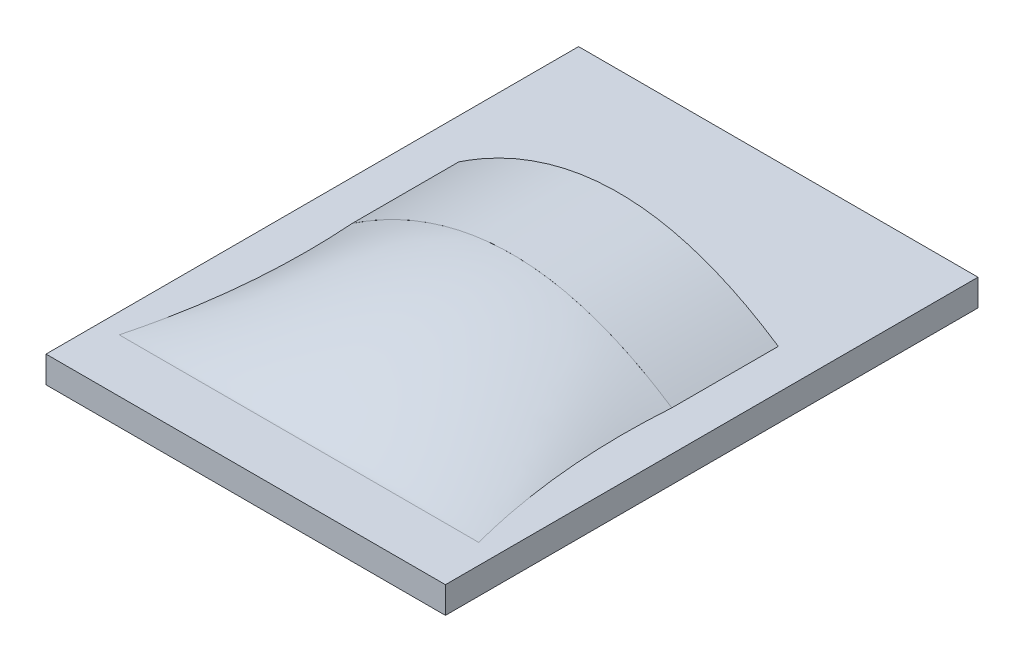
from build123d import *

# Parameters (mm, degrees)
SKIZZE2_W                       = 150
SKIZZE2_H                       = 200
AUFSATZ_LINEAR_AUSTRAGEN1_DEPTH = 10
AUFSATZ_LINEAR_AUSTRAGEN2_DEPTH = 40


with BuildPart() as part:
    # Skizze2 → Aufsatz-Linear austragen1 (new body)
    with BuildSketch(Plane(origin=(0, 0, 0), x_dir=(1, 0, 0), z_dir=(0, 1, 0))):
        Rectangle(SKIZZE2_W, SKIZZE2_H)
    extrude(amount=-AUFSATZ_LINEAR_AUSTRAGEN1_DEPTH)

    # Skizze6 → Aufsatz-Linear austragen2 (add)
    with BuildSketch(Plane.XY):
        with BuildLine():
            Line((-60, 0), (60, 0))
            add(Edge.make_bspline(
                [(-60, 0), (0, 40), (60, 0)],
                knots=[0, 0, 0, 1, 1, 1], degree=2))
        make_face()
    extrude(amount=-AUFSATZ_LINEAR_AUSTRAGEN2_DEPTH)


solid = part.part
